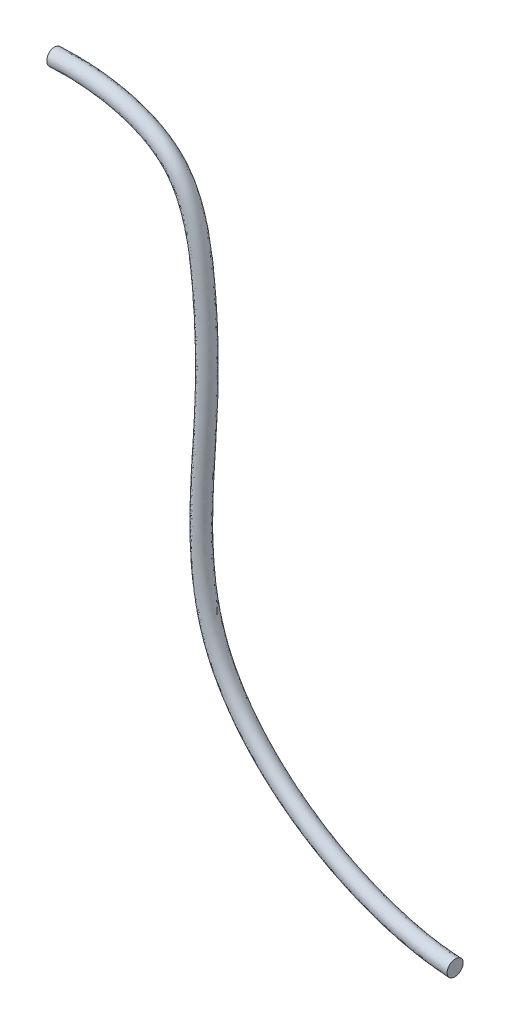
ISO-10303-21;
HEADER;
FILE_DESCRIPTION(('STEP AP214'),'2;1');
FILE_NAME('part.step','',(''),(''),'','','');
FILE_SCHEMA(('AUTOMOTIVE_DESIGN { 1 0 10303 214 1 1 1 1 }'));
ENDSEC;
DATA;
#1=APPLICATION_CONTEXT('core data for automotive mechanical design processes');
#2=APPLICATION_PROTOCOL_DEFINITION('international standard','automotive_design',2000,#1);
#3=PRODUCT_CONTEXT('',#1,'mechanical');
#4=PRODUCT('Part','Part','',(#3));
#5=PRODUCT_RELATED_PRODUCT_CATEGORY('part','',(#4));
#6=PRODUCT_DEFINITION_FORMATION('','',#4);
#7=PRODUCT_DEFINITION_CONTEXT('part definition',#1,'design');
#8=PRODUCT_DEFINITION('design','',#6,#7);
#9=PRODUCT_DEFINITION_SHAPE('','',#8);
#10=(LENGTH_UNIT() NAMED_UNIT(*) SI_UNIT(.MILLI.,.METRE.));
#11=(NAMED_UNIT(*) PLANE_ANGLE_UNIT() SI_UNIT($,.RADIAN.));
#12=(NAMED_UNIT(*) SI_UNIT($,.STERADIAN.) SOLID_ANGLE_UNIT());
#13=UNCERTAINTY_MEASURE_WITH_UNIT(LENGTH_MEASURE(1.E-05),#10,'distance_accuracy_value','');
#14=(GEOMETRIC_REPRESENTATION_CONTEXT(3) GLOBAL_UNCERTAINTY_ASSIGNED_CONTEXT((#13)) GLOBAL_UNIT_ASSIGNED_CONTEXT((#10,
#11,#12)) REPRESENTATION_CONTEXT('',''));
#15=CARTESIAN_POINT('',(0.,0.,0.));
#16=DIRECTION('',(0.,0.,1.));
#17=DIRECTION('',(1.,0.,0.));
#18=AXIS2_PLACEMENT_3D('',#15,#16,#17);
#19=CARTESIAN_POINT('',(20.7322001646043,50.9491304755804,0.));
#20=DIRECTION('',(0.998347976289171,0.0574570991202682,0.));
#21=DIRECTION('',(-0.0574570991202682,0.998347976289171,0.));
#22=AXIS2_PLACEMENT_3D('',#19,#20,#21);
#23=PLANE('',#22);
#24=CARTESIAN_POINT('',(20.7322001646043,50.9491304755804,0.));
#25=DIRECTION('',(0.998347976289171,0.0574570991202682,0.));
#26=DIRECTION('',(-0.0574570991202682,0.998347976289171,0.));
#27=AXIS2_PLACEMENT_3D('',#24,#25,#26);
#28=CIRCLE('',#27,1.27);
#29=CARTESIAN_POINT('',(20.6592296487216,52.2170324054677,0.));
#30=VERTEX_POINT('',#29);
#31=EDGE_CURVE('E48',#30,#30,#28,.T.);
#32=ORIENTED_EDGE('',*,*,#31,.F.);
#33=EDGE_LOOP('',(#32));
#34=FACE_BOUND('',#33,.T.);
#35=ADVANCED_FACE('F41',(#34),#23,.F.);
#36=CARTESIAN_POINT('',(83.7631923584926,-41.7998032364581,0.));
#37=DIRECTION('',(0.998573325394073,-0.05339769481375,0.));
#38=DIRECTION('',(0.05339769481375,0.998573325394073,0.));
#39=AXIS2_PLACEMENT_3D('',#36,#37,#38);
#40=PLANE('',#39);
#41=CARTESIAN_POINT('',(83.7631923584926,-41.7998032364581,0.));
#42=DIRECTION('',(0.998573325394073,-0.05339769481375,0.));
#43=DIRECTION('',(0.05339769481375,0.998573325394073,0.));
#44=AXIS2_PLACEMENT_3D('',#41,#42,#43);
#45=CIRCLE('',#44,1.27);
#46=CARTESIAN_POINT('',(83.8310074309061,-40.5316151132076,0.));
#47=VERTEX_POINT('',#46);
#48=EDGE_CURVE('E12',#47,#47,#45,.T.);
#49=ORIENTED_EDGE('',*,*,#48,.T.);
#50=EDGE_LOOP('',(#49));
#51=FACE_BOUND('',#50,.T.);
#52=ADVANCED_FACE('F55',(#51),#40,.T.);
#53=CARTESIAN_POINT('',(20.6592296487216,52.2170324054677,0.));
#54=CARTESIAN_POINT('',(23.8480677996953,52.4005569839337,0.));
#55=CARTESIAN_POINT('',(27.5791195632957,52.2440986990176,0.));
#56=CARTESIAN_POINT('',(34.6729737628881,50.6243177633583,0.));
#57=CARTESIAN_POINT('',(38.0665150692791,49.1635663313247,0.));
#58=CARTESIAN_POINT('',(42.2649065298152,44.6469946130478,0.));
#59=CARTESIAN_POINT('',(43.366225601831,42.1781283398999,0.));
#60=CARTESIAN_POINT('',(44.8116117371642,36.9611587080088,0.));
#61=CARTESIAN_POINT('',(45.1599569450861,34.1941202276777,0.));
#62=CARTESIAN_POINT('',(45.9505698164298,25.9330999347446,0.));
#63=CARTESIAN_POINT('',(46.0476865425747,20.7346143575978,0.));
#64=CARTESIAN_POINT('',(45.6019252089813,9.90933881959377,0.));
#65=CARTESIAN_POINT('',(45.0664056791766,4.33079484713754,0.));
#66=CARTESIAN_POINT('',(45.0664635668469,-6.4473229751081,0.));
#67=CARTESIAN_POINT('',(45.6032609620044,-11.6320750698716,0.));
#68=CARTESIAN_POINT('',(50.1265571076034,-23.032320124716,0.));
#69=CARTESIAN_POINT('',(55.6743246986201,-28.9324568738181,0.));
#70=CARTESIAN_POINT('',(69.0338751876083,-37.5020015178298,0.));
#71=CARTESIAN_POINT('',(76.8299442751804,-40.1572403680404,0.));
#72=CARTESIAN_POINT('',(83.8310074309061,-40.5316151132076,0.));
#73=CARTESIAN_POINT('',(20.6592296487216,52.2170324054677,2.54));
#74=CARTESIAN_POINT('',(23.8480677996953,52.4005569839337,2.54));
#75=CARTESIAN_POINT('',(27.5791195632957,52.2440986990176,2.54));
#76=CARTESIAN_POINT('',(34.6729737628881,50.6243177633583,2.54));
#77=CARTESIAN_POINT('',(38.0665150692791,49.1635663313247,2.54));
#78=CARTESIAN_POINT('',(42.2649065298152,44.6469946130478,2.54));
#79=CARTESIAN_POINT('',(43.366225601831,42.1781283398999,2.54));
#80=CARTESIAN_POINT('',(44.8116117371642,36.9611587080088,2.54));
#81=CARTESIAN_POINT('',(45.1599569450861,34.1941202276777,2.54));
#82=CARTESIAN_POINT('',(45.9505698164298,25.9330999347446,2.54));
#83=CARTESIAN_POINT('',(46.0476865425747,20.7346143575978,2.54));
#84=CARTESIAN_POINT('',(45.6019252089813,9.90933881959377,2.54));
#85=CARTESIAN_POINT('',(45.0664056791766,4.33079484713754,2.54));
#86=CARTESIAN_POINT('',(45.0664635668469,-6.4473229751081,2.54));
#87=CARTESIAN_POINT('',(45.6032609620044,-11.6320750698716,2.54));
#88=CARTESIAN_POINT('',(50.1265571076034,-23.032320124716,2.54));
#89=CARTESIAN_POINT('',(55.6743246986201,-28.9324568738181,2.54));
#90=CARTESIAN_POINT('',(69.0338751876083,-37.5020015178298,2.54));
#91=CARTESIAN_POINT('',(76.8299442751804,-40.1572403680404,2.54));
#92=CARTESIAN_POINT('',(83.8310074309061,-40.5316151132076,2.54));
#93=CARTESIAN_POINT('',(20.8051706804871,49.6812285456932,2.54));
#94=CARTESIAN_POINT('',(23.7946914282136,49.8532819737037,2.54));
#95=CARTESIAN_POINT('',(27.3248460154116,49.6967854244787,2.54));
#96=CARTESIAN_POINT('',(33.7964063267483,48.2190964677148,2.54));
#97=CARTESIAN_POINT('',(36.7070731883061,46.8953328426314,2.54));
#98=CARTESIAN_POINT('',(40.0227699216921,43.3283519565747,2.54));
#99=CARTESIAN_POINT('',(40.9865471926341,41.2541096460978,2.54));
#100=CARTESIAN_POINT('',(42.2957074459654,36.5288330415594,2.54));
#101=CARTESIAN_POINT('',(42.6368122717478,33.8967338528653,2.54));
#102=CARTESIAN_POINT('',(43.4107810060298,25.8096261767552,2.54));
#103=CARTESIAN_POINT('',(43.5058486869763,20.7422558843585,2.54));
#104=CARTESIAN_POINT('',(43.0680690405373,10.1108149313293,2.54));
#105=CARTESIAN_POINT('',(42.5264047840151,4.49744807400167,2.54));
#106=CARTESIAN_POINT('',(42.5264644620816,-6.61400348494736,2.54));
#107=CARTESIAN_POINT('',(43.0669684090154,-12.1269099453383,2.54));
#108=CARTESIAN_POINT('',(48.0199572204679,-24.610126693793,2.54));
#109=CARTESIAN_POINT('',(53.951501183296,-30.8449921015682,2.54));
#110=CARTESIAN_POINT('',(68.0138950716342,-39.8653788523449,2.54));
#111=CARTESIAN_POINT('',(76.1604588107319,-42.6650692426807,2.54));
#112=CARTESIAN_POINT('',(83.6953772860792,-43.0679913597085,2.54));
#113=CARTESIAN_POINT('',(20.8051706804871,49.6812285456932,0.));
#114=CARTESIAN_POINT('',(23.7946914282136,49.8532819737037,0.));
#115=CARTESIAN_POINT('',(27.3248460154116,49.6967854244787,0.));
#116=CARTESIAN_POINT('',(33.7964063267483,48.2190964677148,0.));
#117=CARTESIAN_POINT('',(36.7070731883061,46.8953328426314,0.));
#118=CARTESIAN_POINT('',(40.0227699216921,43.3283519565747,0.));
#119=CARTESIAN_POINT('',(40.9865471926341,41.2541096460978,0.));
#120=CARTESIAN_POINT('',(42.2957074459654,36.5288330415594,0.));
#121=CARTESIAN_POINT('',(42.6368122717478,33.8967338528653,0.));
#122=CARTESIAN_POINT('',(43.4107810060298,25.8096261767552,0.));
#123=CARTESIAN_POINT('',(43.5058486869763,20.7422558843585,0.));
#124=CARTESIAN_POINT('',(43.0680690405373,10.1108149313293,0.));
#125=CARTESIAN_POINT('',(42.5264047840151,4.49744807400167,0.));
#126=CARTESIAN_POINT('',(42.5264644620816,-6.61400348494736,0.));
#127=CARTESIAN_POINT('',(43.0669684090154,-12.1269099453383,0.));
#128=CARTESIAN_POINT('',(48.0199572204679,-24.610126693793,0.));
#129=CARTESIAN_POINT('',(53.951501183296,-30.8449921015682,0.));
#130=CARTESIAN_POINT('',(68.0138950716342,-39.865378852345,0.));
#131=CARTESIAN_POINT('',(76.1604588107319,-42.6650692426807,0.));
#132=CARTESIAN_POINT('',(83.6953772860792,-43.0679913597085,0.));
#133=CARTESIAN_POINT('',(20.8051706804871,49.6812285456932,-2.54));
#134=CARTESIAN_POINT('',(23.7946914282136,49.8532819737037,-2.54));
#135=CARTESIAN_POINT('',(27.3248460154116,49.6967854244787,-2.54));
#136=CARTESIAN_POINT('',(33.7964063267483,48.2190964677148,-2.54));
#137=CARTESIAN_POINT('',(36.7070731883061,46.8953328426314,-2.54));
#138=CARTESIAN_POINT('',(40.0227699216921,43.3283519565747,-2.54));
#139=CARTESIAN_POINT('',(40.9865471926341,41.2541096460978,-2.54));
#140=CARTESIAN_POINT('',(42.2957074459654,36.5288330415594,-2.54));
#141=CARTESIAN_POINT('',(42.6368122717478,33.8967338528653,-2.54));
#142=CARTESIAN_POINT('',(43.4107810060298,25.8096261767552,-2.54));
#143=CARTESIAN_POINT('',(43.5058486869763,20.7422558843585,-2.54));
#144=CARTESIAN_POINT('',(43.0680690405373,10.1108149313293,-2.54));
#145=CARTESIAN_POINT('',(42.5264047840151,4.49744807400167,-2.54));
#146=CARTESIAN_POINT('',(42.5264644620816,-6.61400348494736,-2.54));
#147=CARTESIAN_POINT('',(43.0669684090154,-12.1269099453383,-2.54));
#148=CARTESIAN_POINT('',(48.0199572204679,-24.610126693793,-2.54));
#149=CARTESIAN_POINT('',(53.951501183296,-30.8449921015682,-2.54));
#150=CARTESIAN_POINT('',(68.0138950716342,-39.8653788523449,-2.54));
#151=CARTESIAN_POINT('',(76.1604588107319,-42.6650692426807,-2.54));
#152=CARTESIAN_POINT('',(83.6953772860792,-43.0679913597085,-2.54));
#153=CARTESIAN_POINT('',(20.6592296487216,52.2170324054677,-2.54));
#154=CARTESIAN_POINT('',(23.8480677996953,52.4005569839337,-2.54));
#155=CARTESIAN_POINT('',(27.5791195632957,52.2440986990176,-2.54));
#156=CARTESIAN_POINT('',(34.6729737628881,50.6243177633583,-2.54));
#157=CARTESIAN_POINT('',(38.0665150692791,49.1635663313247,-2.54));
#158=CARTESIAN_POINT('',(42.2649065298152,44.6469946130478,-2.54));
#159=CARTESIAN_POINT('',(43.366225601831,42.1781283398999,-2.54));
#160=CARTESIAN_POINT('',(44.8116117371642,36.9611587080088,-2.54));
#161=CARTESIAN_POINT('',(45.1599569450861,34.1941202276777,-2.54));
#162=CARTESIAN_POINT('',(45.9505698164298,25.9330999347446,-2.54));
#163=CARTESIAN_POINT('',(46.0476865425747,20.7346143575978,-2.54));
#164=CARTESIAN_POINT('',(45.6019252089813,9.90933881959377,-2.54));
#165=CARTESIAN_POINT('',(45.0664056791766,4.33079484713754,-2.54));
#166=CARTESIAN_POINT('',(45.0664635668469,-6.4473229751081,-2.54));
#167=CARTESIAN_POINT('',(45.6032609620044,-11.6320750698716,-2.54));
#168=CARTESIAN_POINT('',(50.1265571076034,-23.032320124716,-2.54));
#169=CARTESIAN_POINT('',(55.6743246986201,-28.9324568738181,-2.54));
#170=CARTESIAN_POINT('',(69.0338751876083,-37.5020015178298,-2.54));
#171=CARTESIAN_POINT('',(76.8299442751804,-40.1572403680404,-2.54));
#172=CARTESIAN_POINT('',(83.8310074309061,-40.5316151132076,-2.54));
#173=CARTESIAN_POINT('',(20.6592296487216,52.2170324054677,0.));
#174=CARTESIAN_POINT('',(23.8480677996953,52.4005569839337,0.));
#175=CARTESIAN_POINT('',(27.5791195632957,52.2440986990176,0.));
#176=CARTESIAN_POINT('',(34.6729737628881,50.6243177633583,0.));
#177=CARTESIAN_POINT('',(38.0665150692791,49.1635663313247,0.));
#178=CARTESIAN_POINT('',(42.2649065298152,44.6469946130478,0.));
#179=CARTESIAN_POINT('',(43.366225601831,42.1781283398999,0.));
#180=CARTESIAN_POINT('',(44.8116117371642,36.9611587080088,0.));
#181=CARTESIAN_POINT('',(45.1599569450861,34.1941202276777,0.));
#182=CARTESIAN_POINT('',(45.9505698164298,25.9330999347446,0.));
#183=CARTESIAN_POINT('',(46.0476865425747,20.7346143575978,0.));
#184=CARTESIAN_POINT('',(45.6019252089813,9.90933881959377,0.));
#185=CARTESIAN_POINT('',(45.0664056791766,4.33079484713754,0.));
#186=CARTESIAN_POINT('',(45.0664635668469,-6.4473229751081,0.));
#187=CARTESIAN_POINT('',(45.6032609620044,-11.6320750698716,0.));
#188=CARTESIAN_POINT('',(50.1265571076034,-23.032320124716,0.));
#189=CARTESIAN_POINT('',(55.6743246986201,-28.9324568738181,0.));
#190=CARTESIAN_POINT('',(69.0338751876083,-37.5020015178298,0.));
#191=CARTESIAN_POINT('',(76.8299442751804,-40.1572403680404,0.));
#192=CARTESIAN_POINT('',(83.8310074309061,-40.5316151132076,0.));
#193=(BOUNDED_SURFACE() B_SPLINE_SURFACE(3,3,((#53,#54,#55,#56,#57,#58,#59,#60,#61,#62,#63,#64,
#65,#66,#67,#68,#69,#70,#71,#72),(#73,#74,#75,#76,#77,#78,#79,#80,#81,#82,#83,#84,#85,#86,#87,
#88,#89,#90,#91,#92),(#93,#94,#95,#96,#97,#98,#99,#100,#101,#102,#103,#104,#105,#106,#107,#108,
#109,#110,#111,#112),(#113,#114,#115,#116,#117,#118,#119,#120,#121,#122,#123,#124,#125,#126,
#127,#128,#129,#130,#131,#132),(#133,#134,#135,#136,#137,#138,#139,#140,#141,#142,#143,#144,
#145,#146,#147,#148,#149,#150,#151,#152),(#153,#154,#155,#156,#157,#158,#159,#160,#161,#162,
#163,#164,#165,#166,#167,#168,#169,#170,#171,#172),(#173,#174,#175,#176,#177,#178,#179,#180,
#181,#182,#183,#184,#185,#186,#187,#188,#189,#190,#191,#192)),.UNSPECIFIED.,.T.,.F.,
.F.) B_SPLINE_SURFACE_WITH_KNOTS((4,3,4),(4,2,2,2,2,2,2,2,2,4),(0.,0.5,1.),(0.,
0.0760306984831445,0.152061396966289,0.210001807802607,0.267942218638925,0.391876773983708,
0.515953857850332,0.640030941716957,0.820015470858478,1.),
.UNSPECIFIED.) GEOMETRIC_REPRESENTATION_ITEM() RATIONAL_B_SPLINE_SURFACE(((1.,1.,1.,1.,1.,1.,1.,
1.,1.,1.,1.,1.,1.,1.,1.,1.,1.,1.,1.,1.),(0.333333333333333,0.333333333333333,0.333333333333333,
0.333333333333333,0.333333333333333,0.333333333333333,0.333333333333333,0.333333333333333,
0.333333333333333,0.333333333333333,0.333333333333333,0.333333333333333,0.333333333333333,
0.333333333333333,0.333333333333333,0.333333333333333,0.333333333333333,0.333333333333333,
0.333333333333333,0.333333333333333),(0.333333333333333,0.333333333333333,0.333333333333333,
0.333333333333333,0.333333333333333,0.333333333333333,0.333333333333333,0.333333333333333,
0.333333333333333,0.333333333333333,0.333333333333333,0.333333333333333,0.333333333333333,
0.333333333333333,0.333333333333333,0.333333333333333,0.333333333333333,0.333333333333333,
0.333333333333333,0.333333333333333),(1.,1.,1.,1.,1.,1.,1.,1.,1.,1.,1.,1.,1.,1.,1.,1.,1.,1.,1.,
1.),(0.333333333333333,0.333333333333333,0.333333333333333,0.333333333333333,0.333333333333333,
0.333333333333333,0.333333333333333,0.333333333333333,0.333333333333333,0.333333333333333,
0.333333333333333,0.333333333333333,0.333333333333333,0.333333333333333,0.333333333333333,
0.333333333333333,0.333333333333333,0.333333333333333,0.333333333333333,0.333333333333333),
(0.333333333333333,0.333333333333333,0.333333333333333,0.333333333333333,0.333333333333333,
0.333333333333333,0.333333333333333,0.333333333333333,0.333333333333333,0.333333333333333,
0.333333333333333,0.333333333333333,0.333333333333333,0.333333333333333,0.333333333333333,
0.333333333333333,0.333333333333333,0.333333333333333,0.333333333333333,0.333333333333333),(1.,
1.,1.,1.,1.,1.,1.,1.,1.,1.,1.,1.,1.,1.,1.,1.,1.,1.,1.,1.))) REPRESENTATION_ITEM('') SURFACE());
#194=ORIENTED_EDGE('',*,*,#48,.F.);
#195=EDGE_LOOP('',(#194));
#196=FACE_BOUND('',#195,.T.);
#197=ORIENTED_EDGE('',*,*,#31,.T.);
#198=EDGE_LOOP('',(#197));
#199=FACE_BOUND('',#198,.T.);
#200=ADVANCED_FACE('F57',(#196,#199),#193,.T.);
#201=CLOSED_SHELL('',(#35,#52,#200));
#202=MANIFOLD_SOLID_BREP('B2',#201);
#203=ADVANCED_BREP_SHAPE_REPRESENTATION('',(#18,#202),#14);
#204=SHAPE_DEFINITION_REPRESENTATION(#9,#203);
ENDSEC;
END-ISO-10303-21;
